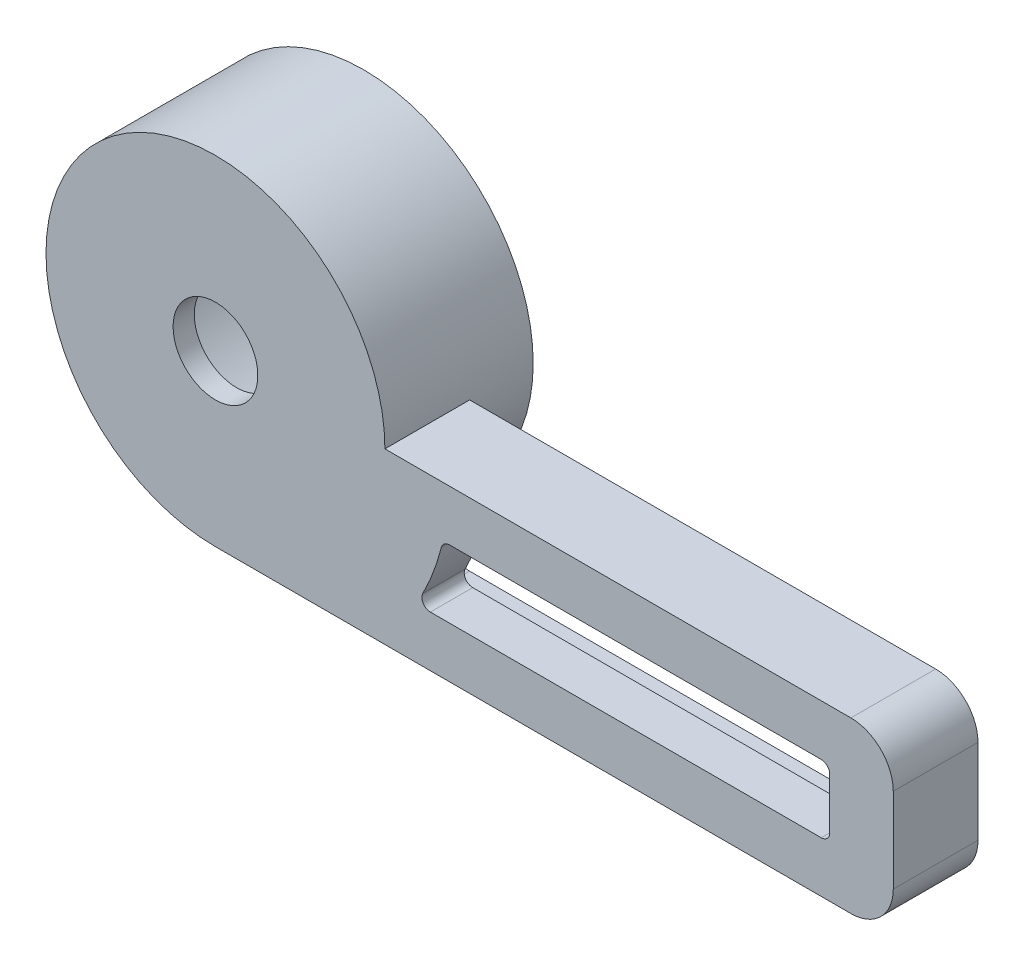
from build123d import *

# Parameters (mm, degrees)
BASE_EXTRUDE_DEPTH  = 20
SKETCH3_R           = 40
BOSS_EXTRUDE1_DEPTH = 35
SKETCH4_R           = 35
CUT_EXTRUDE1_DEPTH  = 30
CUT_EXTRUDE2_DEPTH  = 10
SKETCH6_R           = 10
CUT_EXTRUDE3_DEPTH  = 121.415945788
CUT_EXTRUDE5_DEPTH  = 120.268604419


with BuildPart() as part:
    # Sketch1 → Base-Extrude (new body)
    with BuildSketch(Plane.XY):
        with BuildLine():
            Line((90, -20), (-60, -20))
            Line((-60, -20), (-60, 20))
            Line((-60, 20), (90, 20))
            ThreePointArc((90, 20), (97.071067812, 17.071067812), (100, 10))
            Line((100, 10), (100, -10))
            ThreePointArc((100, -10), (97.071067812, -17.071067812), (90, -20))
        make_face()
    extrude(amount=-BASE_EXTRUDE_DEPTH)

    # Sketch3 → Boss-Extrude1 (add)
    with BuildSketch(Plane.XY):
        with Locations((-60, 20)):
            Circle(SKETCH3_R)
    extrude(amount=-BOSS_EXTRUDE1_DEPTH)

    # Sketch4 → Cut-Extrude1 (cut)
    with BuildSketch(Plane(origin=(0, 0, -35), x_dir=(-1, 0, 0), z_dir=(0, 0, -1))):
        with Locations((60, 20)):
            Circle(SKETCH4_R)
    extrude(amount=-CUT_EXTRUDE1_DEPTH, mode=Mode.SUBTRACT)

    # Sketch5 → Cut-Extrude2 (cut)
    with BuildSketch(Plane(origin=(0, 0, -20), x_dir=(-1, 0, 0), z_dir=(0, 0, -1))):
        with BuildLine():
            Line((-90, -15), (20, -15))
            ThreePointArc((20, -15), (24.472135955, -12.236067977), (24, -7))
            ThreePointArc((24, -7), (18.955698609, 1.551007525), (15.90918463, 11))
            ThreePointArc((15.90918463, 11), (14.172482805, 13.872983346), (11.010205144, 15))
            Line((11.010205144, 15), (-90, 15))
            ThreePointArc((-90, 15), (-93.535533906, 13.535533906), (-95, 10))
            Line((-95, 10), (-95, -10))
            ThreePointArc((-95, -10), (-93.535533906, -13.535533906), (-90, -15))
        make_face()
    extrude(amount=-CUT_EXTRUDE2_DEPTH, mode=Mode.SUBTRACT)

    # Sketch6 → Cut-Extrude3 (cut, through all)
    with BuildSketch(Plane(origin=(0, 0, -5), x_dir=(-1, 0, 0), z_dir=(0, 0, -1))):
        with Locations((60, 20)):
            Circle(SKETCH6_R)
    extrude(amount=-CUT_EXTRUDE3_DEPTH, mode=Mode.SUBTRACT)

    # Sketch8 → Cut-Extrude5 (cut, through all)
    with BuildSketch(Plane(origin=(0, 0, -10), x_dir=(-1, 0, 0), z_dir=(0, 0, -1))):
        with BuildLine():
            Line((-83, -8), (9.275252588, -8))
            ThreePointArc((9.275252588, -8), (10.981793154, -7.042937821), (11.055068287, -5.087719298))
            ThreePointArc((11.055068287, -5.087719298), (8.543194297, 0.578436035), (6.684776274, 6.49122807))
            ThreePointArc((6.684776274, 6.49122807), (5.974361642, 7.578362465), (4.746040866, 8))
            Line((4.746040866, 8), (-83, 8))
            ThreePointArc((-83, 8), (-84.414213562, 7.414213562), (-85, 6))
            Line((-85, 6), (-85, -6))
            ThreePointArc((-85, -6), (-84.414213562, -7.414213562), (-83, -8))
        make_face()
    extrude(amount=-CUT_EXTRUDE5_DEPTH, mode=Mode.SUBTRACT)


solid = part.part
